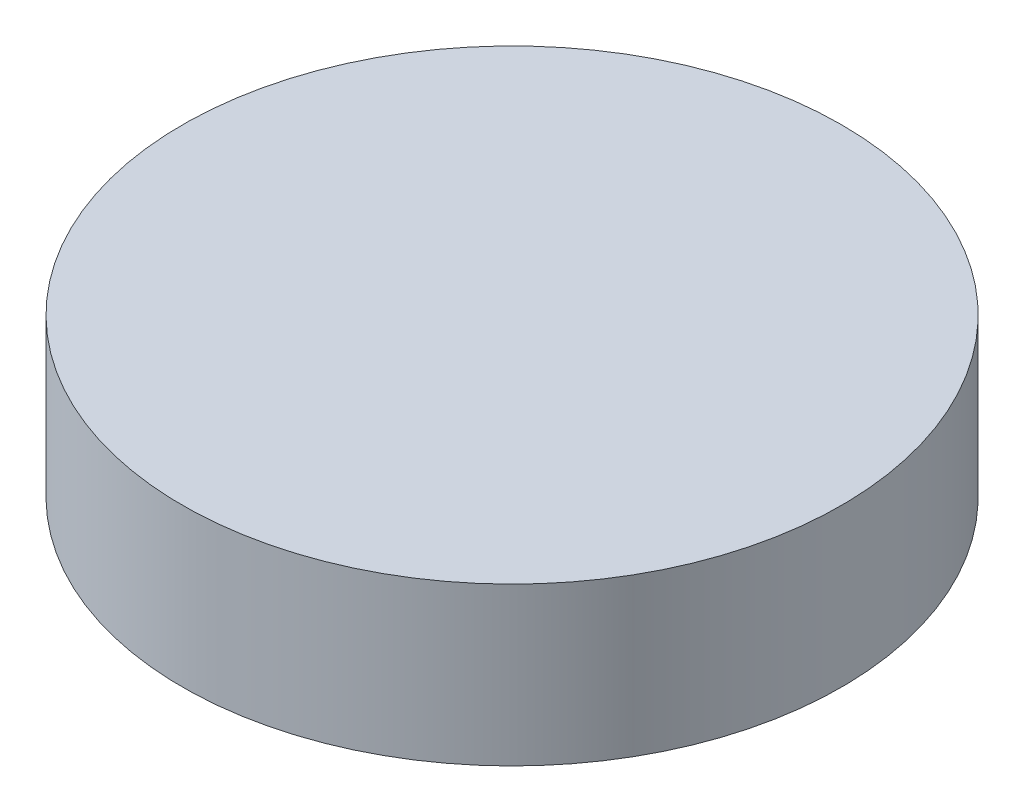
ISO-10303-21;
HEADER;
FILE_DESCRIPTION(('STEP AP214'),'2;1');
FILE_NAME('part.step','',(''),(''),'','','');
FILE_SCHEMA(('AUTOMOTIVE_DESIGN { 1 0 10303 214 1 1 1 1 }'));
ENDSEC;
DATA;
#1=APPLICATION_CONTEXT('core data for automotive mechanical design processes');
#2=APPLICATION_PROTOCOL_DEFINITION('international standard','automotive_design',2000,#1);
#3=PRODUCT_CONTEXT('',#1,'mechanical');
#4=PRODUCT('Part','Part','',(#3));
#5=PRODUCT_RELATED_PRODUCT_CATEGORY('part','',(#4));
#6=PRODUCT_DEFINITION_FORMATION('','',#4);
#7=PRODUCT_DEFINITION_CONTEXT('part definition',#1,'design');
#8=PRODUCT_DEFINITION('design','',#6,#7);
#9=PRODUCT_DEFINITION_SHAPE('','',#8);
#10=(LENGTH_UNIT() NAMED_UNIT(*) SI_UNIT(.MILLI.,.METRE.));
#11=(NAMED_UNIT(*) PLANE_ANGLE_UNIT() SI_UNIT($,.RADIAN.));
#12=(NAMED_UNIT(*) SI_UNIT($,.STERADIAN.) SOLID_ANGLE_UNIT());
#13=UNCERTAINTY_MEASURE_WITH_UNIT(LENGTH_MEASURE(1.E-05),#10,'distance_accuracy_value','');
#14=(GEOMETRIC_REPRESENTATION_CONTEXT(3) GLOBAL_UNCERTAINTY_ASSIGNED_CONTEXT((#13)) GLOBAL_UNIT_ASSIGNED_CONTEXT((#10,
#11,#12)) REPRESENTATION_CONTEXT('',''));
#15=CARTESIAN_POINT('',(0.,0.,0.));
#16=DIRECTION('',(0.,0.,1.));
#17=DIRECTION('',(1.,0.,0.));
#18=AXIS2_PLACEMENT_3D('',#15,#16,#17);
#19=CARTESIAN_POINT('',(0.,380.,0.));
#20=DIRECTION('',(0.,1.,0.));
#21=DIRECTION('',(0.,0.,1.));
#22=AXIS2_PLACEMENT_3D('',#19,#20,#21);
#23=PLANE('',#22);
#24=CARTESIAN_POINT('',(0.,380.,0.));
#25=DIRECTION('',(0.,-1.,0.));
#26=DIRECTION('',(0.,0.,-1.));
#27=AXIS2_PLACEMENT_3D('',#24,#25,#26);
#28=CIRCLE('',#27,565.);
#29=CARTESIAN_POINT('',(0.,380.,-565.));
#30=VERTEX_POINT('',#29);
#31=EDGE_CURVE('E12',#30,#30,#28,.T.);
#32=ORIENTED_EDGE('',*,*,#31,.F.);
#33=EDGE_LOOP('',(#32));
#34=FACE_BOUND('',#33,.T.);
#35=ADVANCED_FACE('F45',(#34),#23,.T.);
#36=CARTESIAN_POINT('',(0.,0.,0.));
#37=DIRECTION('',(0.,-1.,0.));
#38=DIRECTION('',(0.,0.,-1.));
#39=AXIS2_PLACEMENT_3D('',#36,#37,#38);
#40=CYLINDRICAL_SURFACE('',#39,565.);
#41=ORIENTED_EDGE('',*,*,#31,.T.);
#42=EDGE_LOOP('',(#41));
#43=FACE_BOUND('',#42,.T.);
#44=CARTESIAN_POINT('',(0.,110.,0.));
#45=DIRECTION('',(0.,-1.,0.));
#46=DIRECTION('',(0.,0.,-1.));
#47=AXIS2_PLACEMENT_3D('',#44,#45,#46);
#48=CIRCLE('',#47,565.);
#49=CARTESIAN_POINT('',(0.,110.,-565.));
#50=VERTEX_POINT('',#49);
#51=EDGE_CURVE('E51',#50,#50,#48,.T.);
#52=ORIENTED_EDGE('',*,*,#51,.F.);
#53=EDGE_LOOP('',(#52));
#54=FACE_BOUND('',#53,.T.);
#55=ADVANCED_FACE('F66',(#43,#54),#40,.T.);
#56=CARTESIAN_POINT('',(0.,0.,0.));
#57=DIRECTION('',(0.,1.,0.));
#58=DIRECTION('',(0.,0.,1.));
#59=AXIS2_PLACEMENT_3D('',#56,#57,#58);
#60=CONICAL_SURFACE('',#59,360.,1.07831056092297);
#61=ORIENTED_EDGE('',*,*,#51,.T.);
#62=EDGE_LOOP('',(#61));
#63=FACE_BOUND('',#62,.T.);
#64=CARTESIAN_POINT('',(0.,0.,0.));
#65=DIRECTION('',(0.,-1.,0.));
#66=DIRECTION('',(0.,0.,-1.));
#67=AXIS2_PLACEMENT_3D('',#64,#65,#66);
#68=CIRCLE('',#67,360.);
#69=CARTESIAN_POINT('',(0.,0.,-360.));
#70=VERTEX_POINT('',#69);
#71=EDGE_CURVE('E55',#70,#70,#68,.T.);
#72=ORIENTED_EDGE('',*,*,#71,.F.);
#73=EDGE_LOOP('',(#72));
#74=FACE_BOUND('',#73,.T.);
#75=ADVANCED_FACE('F64',(#63,#74),#60,.T.);
#76=CARTESIAN_POINT('',(360.,0.,0.));
#77=DIRECTION('',(0.,-1.,0.));
#78=DIRECTION('',(0.,0.,-1.));
#79=AXIS2_PLACEMENT_3D('',#76,#77,#78);
#80=PLANE('',#79);
#81=ORIENTED_EDGE('',*,*,#71,.T.);
#82=EDGE_LOOP('',(#81));
#83=FACE_BOUND('',#82,.T.);
#84=ADVANCED_FACE('F62',(#83),#80,.T.);
#85=CLOSED_SHELL('',(#35,#55,#75,#84));
#86=MANIFOLD_SOLID_BREP('B2',#85);
#87=ADVANCED_BREP_SHAPE_REPRESENTATION('',(#18,#86),#14);
#88=SHAPE_DEFINITION_REPRESENTATION(#9,#87);
ENDSEC;
END-ISO-10303-21;
